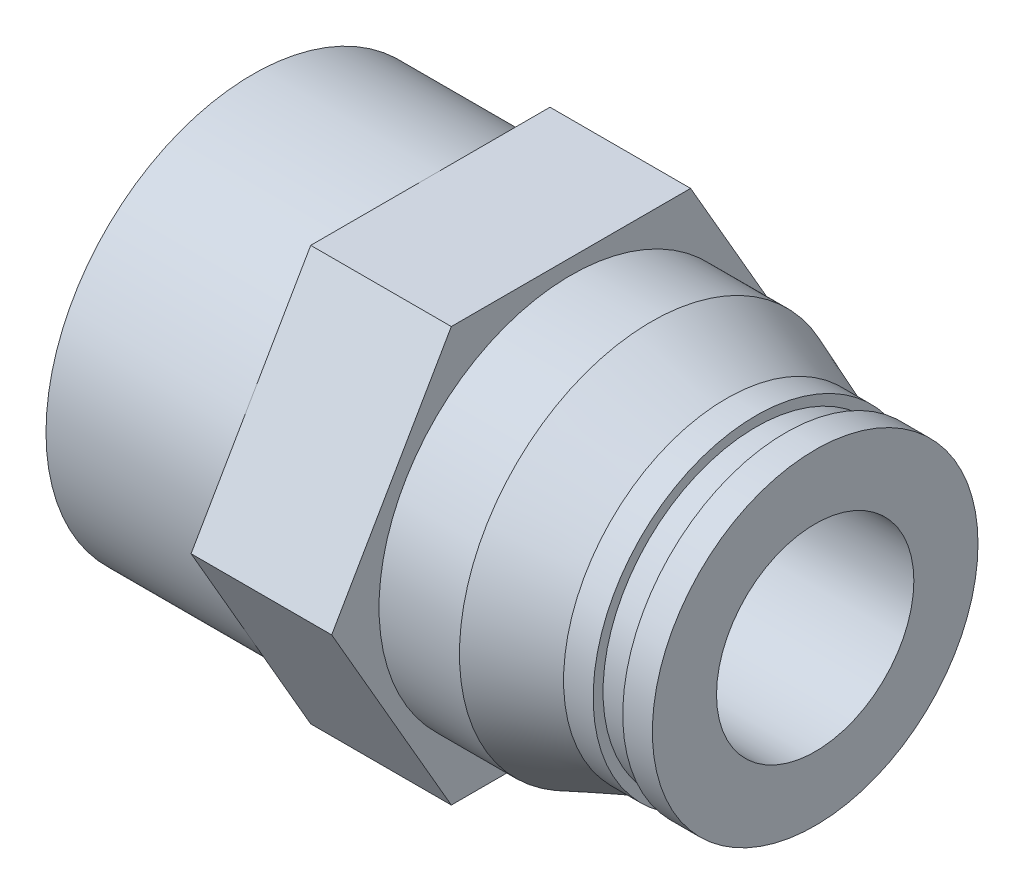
ISO-10303-21;
HEADER;
FILE_DESCRIPTION(('STEP AP214'),'2;1');
FILE_NAME('part.step','',(''),(''),'','','');
FILE_SCHEMA(('AUTOMOTIVE_DESIGN { 1 0 10303 214 1 1 1 1 }'));
ENDSEC;
DATA;
#1=APPLICATION_CONTEXT('core data for automotive mechanical design processes');
#2=APPLICATION_PROTOCOL_DEFINITION('international standard','automotive_design',2000,#1);
#3=PRODUCT_CONTEXT('',#1,'mechanical');
#4=PRODUCT('Part','Part','',(#3));
#5=PRODUCT_RELATED_PRODUCT_CATEGORY('part','',(#4));
#6=PRODUCT_DEFINITION_FORMATION('','',#4);
#7=PRODUCT_DEFINITION_CONTEXT('part definition',#1,'design');
#8=PRODUCT_DEFINITION('design','',#6,#7);
#9=PRODUCT_DEFINITION_SHAPE('','',#8);
#10=(LENGTH_UNIT() NAMED_UNIT(*) SI_UNIT(.MILLI.,.METRE.));
#11=(NAMED_UNIT(*) PLANE_ANGLE_UNIT() SI_UNIT($,.RADIAN.));
#12=(NAMED_UNIT(*) SI_UNIT($,.STERADIAN.) SOLID_ANGLE_UNIT());
#13=UNCERTAINTY_MEASURE_WITH_UNIT(LENGTH_MEASURE(1.E-05),#10,'distance_accuracy_value','');
#14=(GEOMETRIC_REPRESENTATION_CONTEXT(3) GLOBAL_UNCERTAINTY_ASSIGNED_CONTEXT((#13)) GLOBAL_UNIT_ASSIGNED_CONTEXT((#10,
#11,#12)) REPRESENTATION_CONTEXT('',''));
#15=CARTESIAN_POINT('',(0.,0.,0.));
#16=DIRECTION('',(0.,0.,1.));
#17=DIRECTION('',(1.,0.,0.));
#18=AXIS2_PLACEMENT_3D('',#15,#16,#17);
#19=CARTESIAN_POINT('',(9.,10.475,0.));
#20=DIRECTION('',(-1.,0.,0.));
#21=DIRECTION('',(0.,0.,1.));
#22=AXIS2_PLACEMENT_3D('',#19,#20,#21);
#23=PLANE('',#22);
#24=CARTESIAN_POINT('',(9.,0.,0.));
#25=DIRECTION('',(1.,0.,0.));
#26=DIRECTION('',(0.,0.,-1.));
#27=AXIS2_PLACEMENT_3D('',#24,#25,#26);
#28=CIRCLE('',#27,10.475);
#29=CARTESIAN_POINT('',(9.,0.,-10.475));
#30=VERTEX_POINT('',#29);
#31=EDGE_CURVE('E215',#30,#30,#28,.T.);
#32=ORIENTED_EDGE('',*,*,#31,.T.);
#33=EDGE_LOOP('',(#32));
#34=FACE_BOUND('',#33,.T.);
#35=DIRECTION('',(0.,-0.866025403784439,0.5));
#36=VECTOR('',#35,1.);
#37=CARTESIAN_POINT('',(9.,0.,-12.1243556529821));
#38=LINE('',#37,#36);
#39=CARTESIAN_POINT('',(9.,0.,-12.1243556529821));
#40=VERTEX_POINT('',#39);
#41=CARTESIAN_POINT('',(9.,-10.5,-6.06217782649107));
#42=VERTEX_POINT('',#41);
#43=EDGE_CURVE('E121',#40,#42,#38,.T.);
#44=ORIENTED_EDGE('',*,*,#43,.T.);
#45=DIRECTION('',(0.,0.,1.));
#46=VECTOR('',#45,1.);
#47=CARTESIAN_POINT('',(9.,-10.5,-6.06217782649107));
#48=LINE('',#47,#46);
#49=CARTESIAN_POINT('',(9.,-10.5,6.06217782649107));
#50=VERTEX_POINT('',#49);
#51=EDGE_CURVE('E106',#42,#50,#48,.T.);
#52=ORIENTED_EDGE('',*,*,#51,.T.);
#53=DIRECTION('',(0.,0.866025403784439,0.5));
#54=VECTOR('',#53,1.);
#55=CARTESIAN_POINT('',(9.,-10.5,6.06217782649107));
#56=LINE('',#55,#54);
#57=CARTESIAN_POINT('',(9.,0.,12.1243556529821));
#58=VERTEX_POINT('',#57);
#59=EDGE_CURVE('E115',#50,#58,#56,.T.);
#60=ORIENTED_EDGE('',*,*,#59,.T.);
#61=DIRECTION('',(0.,0.866025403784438,-0.5));
#62=VECTOR('',#61,1.);
#63=CARTESIAN_POINT('',(9.,0.,12.1243556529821));
#64=LINE('',#63,#62);
#65=CARTESIAN_POINT('',(9.,10.5,6.06217782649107));
#66=VERTEX_POINT('',#65);
#67=EDGE_CURVE('E30',#58,#66,#64,.T.);
#68=ORIENTED_EDGE('',*,*,#67,.T.);
#69=DIRECTION('',(0.,0.,-1.));
#70=VECTOR('',#69,1.);
#71=CARTESIAN_POINT('',(9.,10.5,6.06217782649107));
#72=LINE('',#71,#70);
#73=CARTESIAN_POINT('',(9.,10.5,-6.06217782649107));
#74=VERTEX_POINT('',#73);
#75=EDGE_CURVE('E125',#66,#74,#72,.T.);
#76=ORIENTED_EDGE('',*,*,#75,.T.);
#77=DIRECTION('',(0.,-0.866025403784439,-0.5));
#78=VECTOR('',#77,1.);
#79=CARTESIAN_POINT('',(9.,10.5,-6.06217782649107));
#80=LINE('',#79,#78);
#81=EDGE_CURVE('E128',#74,#40,#80,.T.);
#82=ORIENTED_EDGE('',*,*,#81,.T.);
#83=EDGE_LOOP('',(#44,#52,#60,#68,#76,#82));
#84=FACE_BOUND('',#83,.T.);
#85=ADVANCED_FACE('F15',(#34,#84),#23,.T.);
#86=CARTESIAN_POINT('',(16.125,12.5,0.));
#87=DIRECTION('',(1.,0.,0.));
#88=DIRECTION('',(0.,0.,-1.));
#89=AXIS2_PLACEMENT_3D('',#86,#87,#88);
#90=PLANE('',#89);
#91=CARTESIAN_POINT('',(16.125,0.,0.));
#92=DIRECTION('',(1.,0.,0.));
#93=DIRECTION('',(0.,0.,-1.));
#94=AXIS2_PLACEMENT_3D('',#91,#92,#93);
#95=CIRCLE('',#94,9.72578013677);
#96=CARTESIAN_POINT('',(16.125,0.,-9.72578013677));
#97=VERTEX_POINT('',#96);
#98=EDGE_CURVE('E212',#97,#97,#95,.T.);
#99=ORIENTED_EDGE('',*,*,#98,.F.);
#100=EDGE_LOOP('',(#99));
#101=FACE_BOUND('',#100,.T.);
#102=DIRECTION('',(0.,0.866025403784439,0.5));
#103=VECTOR('',#102,1.);
#104=CARTESIAN_POINT('',(16.125,-10.5,6.06217782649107));
#105=LINE('',#104,#103);
#106=CARTESIAN_POINT('',(16.125,-10.5,6.06217782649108));
#107=VERTEX_POINT('',#106);
#108=CARTESIAN_POINT('',(16.125,0.,12.1243556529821));
#109=VERTEX_POINT('',#108);
#110=EDGE_CURVE('E132',#107,#109,#105,.T.);
#111=ORIENTED_EDGE('',*,*,#110,.F.);
#112=DIRECTION('',(0.,0.,1.));
#113=VECTOR('',#112,1.);
#114=CARTESIAN_POINT('',(16.125,-10.5,-6.06217782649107));
#115=LINE('',#114,#113);
#116=CARTESIAN_POINT('',(16.125,-10.5,-6.06217782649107));
#117=VERTEX_POINT('',#116);
#118=EDGE_CURVE('E38',#117,#107,#115,.T.);
#119=ORIENTED_EDGE('',*,*,#118,.F.);
#120=DIRECTION('',(0.,-0.866025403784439,0.5));
#121=VECTOR('',#120,1.);
#122=CARTESIAN_POINT('',(16.125,0.,-12.1243556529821));
#123=LINE('',#122,#121);
#124=CARTESIAN_POINT('',(16.125,0.,-12.1243556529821));
#125=VERTEX_POINT('',#124);
#126=EDGE_CURVE('E112',#125,#117,#123,.T.);
#127=ORIENTED_EDGE('',*,*,#126,.F.);
#128=DIRECTION('',(0.,-0.866025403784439,-0.5));
#129=VECTOR('',#128,1.);
#130=CARTESIAN_POINT('',(16.125,10.5,-6.06217782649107));
#131=LINE('',#130,#129);
#132=CARTESIAN_POINT('',(16.125,10.5,-6.06217782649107));
#133=VERTEX_POINT('',#132);
#134=EDGE_CURVE('E140',#133,#125,#131,.T.);
#135=ORIENTED_EDGE('',*,*,#134,.F.);
#136=DIRECTION('',(0.,0.,-1.));
#137=VECTOR('',#136,1.);
#138=CARTESIAN_POINT('',(16.125,10.5,6.06217782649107));
#139=LINE('',#138,#137);
#140=CARTESIAN_POINT('',(16.125,10.5,6.06217782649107));
#141=VERTEX_POINT('',#140);
#142=EDGE_CURVE('E137',#141,#133,#139,.T.);
#143=ORIENTED_EDGE('',*,*,#142,.F.);
#144=DIRECTION('',(0.,0.866025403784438,-0.5));
#145=VECTOR('',#144,1.);
#146=CARTESIAN_POINT('',(16.125,0.,12.1243556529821));
#147=LINE('',#146,#145);
#148=EDGE_CURVE('E134',#109,#141,#147,.T.);
#149=ORIENTED_EDGE('',*,*,#148,.F.);
#150=EDGE_LOOP('',(#111,#119,#127,#135,#143,#149));
#151=FACE_BOUND('',#150,.T.);
#152=ADVANCED_FACE('F269',(#101,#151),#90,.T.);
#153=CARTESIAN_POINT('',(0.,0.,0.));
#154=DIRECTION('',(-1.,0.,0.));
#155=DIRECTION('',(0.,0.,1.));
#156=AXIS2_PLACEMENT_3D('',#153,#154,#155);
#157=PLANE('',#156);
#158=CARTESIAN_POINT('',(0.,0.,0.));
#159=DIRECTION('',(1.,0.,0.));
#160=DIRECTION('',(0.,0.,-1.));
#161=AXIS2_PLACEMENT_3D('',#158,#159,#160);
#162=CIRCLE('',#161,10.475);
#163=CARTESIAN_POINT('',(0.,0.,-10.475));
#164=VERTEX_POINT('',#163);
#165=EDGE_CURVE('E218',#164,#164,#162,.T.);
#166=ORIENTED_EDGE('',*,*,#165,.F.);
#167=EDGE_LOOP('',(#166));
#168=FACE_BOUND('',#167,.T.);
#169=DIRECTION('',(0.,-0.866025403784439,-0.5));
#170=VECTOR('',#169,1.);
#171=CARTESIAN_POINT('',(0.,0.,4.618802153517));
#172=LINE('',#171,#170);
#173=CARTESIAN_POINT('',(0.,0.,4.618802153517));
#174=VERTEX_POINT('',#173);
#175=CARTESIAN_POINT('',(0.,-4.,2.3094010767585));
#176=VERTEX_POINT('',#175);
#177=EDGE_CURVE('E169',#174,#176,#172,.T.);
#178=ORIENTED_EDGE('',*,*,#177,.T.);
#179=DIRECTION('',(0.,0.,-1.));
#180=VECTOR('',#179,1.);
#181=CARTESIAN_POINT('',(0.,-4.,2.3094010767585));
#182=LINE('',#181,#180);
#183=CARTESIAN_POINT('',(0.,-4.,-2.30940107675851));
#184=VERTEX_POINT('',#183);
#185=EDGE_CURVE('E147',#176,#184,#182,.T.);
#186=ORIENTED_EDGE('',*,*,#185,.T.);
#187=DIRECTION('',(0.,0.866025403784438,-0.5));
#188=VECTOR('',#187,1.);
#189=CARTESIAN_POINT('',(0.,-4.,-2.30940107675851));
#190=LINE('',#189,#188);
#191=CARTESIAN_POINT('',(0.,0.,-4.61880215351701));
#192=VERTEX_POINT('',#191);
#193=EDGE_CURVE('E157',#184,#192,#190,.T.);
#194=ORIENTED_EDGE('',*,*,#193,.T.);
#195=DIRECTION('',(0.,0.866025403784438,0.5));
#196=VECTOR('',#195,1.);
#197=CARTESIAN_POINT('',(0.,0.,-4.61880215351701));
#198=LINE('',#197,#196);
#199=CARTESIAN_POINT('',(0.,4.,-2.3094010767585));
#200=VERTEX_POINT('',#199);
#201=EDGE_CURVE('E160',#192,#200,#198,.T.);
#202=ORIENTED_EDGE('',*,*,#201,.T.);
#203=DIRECTION('',(0.,0.,1.));
#204=VECTOR('',#203,1.);
#205=CARTESIAN_POINT('',(0.,4.,-2.3094010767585));
#206=LINE('',#205,#204);
#207=CARTESIAN_POINT('',(0.,4.,2.3094010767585));
#208=VERTEX_POINT('',#207);
#209=EDGE_CURVE('E163',#200,#208,#206,.T.);
#210=ORIENTED_EDGE('',*,*,#209,.T.);
#211=DIRECTION('',(0.,-0.866025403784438,0.5));
#212=VECTOR('',#211,1.);
#213=CARTESIAN_POINT('',(0.,4.,2.3094010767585));
#214=LINE('',#213,#212);
#215=EDGE_CURVE('E166',#208,#174,#214,.T.);
#216=ORIENTED_EDGE('',*,*,#215,.T.);
#217=EDGE_LOOP('',(#178,#186,#194,#202,#210,#216));
#218=FACE_BOUND('',#217,.T.);
#219=ADVANCED_FACE('F17',(#168,#218),#157,.T.);
#220=CARTESIAN_POINT('',(10.,5.,0.));
#221=DIRECTION('',(1.,0.,0.));
#222=DIRECTION('',(0.,0.,-1.));
#223=AXIS2_PLACEMENT_3D('',#220,#221,#222);
#224=PLANE('',#223);
#225=CARTESIAN_POINT('',(10.,0.,0.));
#226=DIRECTION('',(1.,0.,0.));
#227=DIRECTION('',(0.,0.,-1.));
#228=AXIS2_PLACEMENT_3D('',#225,#226,#227);
#229=CIRCLE('',#228,5.);
#230=CARTESIAN_POINT('',(10.,0.,-5.));
#231=VERTEX_POINT('',#230);
#232=EDGE_CURVE('E185',#231,#231,#229,.T.);
#233=ORIENTED_EDGE('',*,*,#232,.T.);
#234=EDGE_LOOP('',(#233));
#235=FACE_BOUND('',#234,.T.);
#236=DIRECTION('',(0.,-0.866025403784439,0.5));
#237=VECTOR('',#236,1.);
#238=CARTESIAN_POINT('',(10.,1.75,-5.62916512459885));
#239=LINE('',#238,#237);
#240=CARTESIAN_POINT('',(10.,0.,-4.61880215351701));
#241=VERTEX_POINT('',#240);
#242=CARTESIAN_POINT('',(10.,-4.,-2.30940107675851));
#243=VERTEX_POINT('',#242);
#244=EDGE_CURVE('E23',#241,#243,#239,.T.);
#245=ORIENTED_EDGE('',*,*,#244,.T.);
#246=DIRECTION('',(0.,0.,1.));
#247=VECTOR('',#246,1.);
#248=CARTESIAN_POINT('',(10.,-4.,0.));
#249=LINE('',#248,#247);
#250=CARTESIAN_POINT('',(10.,-4.,2.3094010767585));
#251=VERTEX_POINT('',#250);
#252=EDGE_CURVE('E9',#243,#251,#249,.T.);
#253=ORIENTED_EDGE('',*,*,#252,.T.);
#254=DIRECTION('',(0.,0.866025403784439,0.5));
#255=VECTOR('',#254,1.);
#256=CARTESIAN_POINT('',(10.,1.75,5.62916512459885));
#257=LINE('',#256,#255);
#258=CARTESIAN_POINT('',(10.,0.,4.618802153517));
#259=VERTEX_POINT('',#258);
#260=EDGE_CURVE('E221',#251,#259,#257,.T.);
#261=ORIENTED_EDGE('',*,*,#260,.T.);
#262=DIRECTION('',(0.,0.866025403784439,-0.5));
#263=VECTOR('',#262,1.);
#264=CARTESIAN_POINT('',(10.,5.75,1.29903810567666));
#265=LINE('',#264,#263);
#266=CARTESIAN_POINT('',(10.,4.,2.3094010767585));
#267=VERTEX_POINT('',#266);
#268=EDGE_CURVE('E224',#259,#267,#265,.T.);
#269=ORIENTED_EDGE('',*,*,#268,.T.);
#270=DIRECTION('',(0.,0.,-1.));
#271=VECTOR('',#270,1.);
#272=CARTESIAN_POINT('',(10.,4.,0.));
#273=LINE('',#272,#271);
#274=CARTESIAN_POINT('',(10.,4.,-2.3094010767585));
#275=VERTEX_POINT('',#274);
#276=EDGE_CURVE('E227',#267,#275,#273,.T.);
#277=ORIENTED_EDGE('',*,*,#276,.T.);
#278=DIRECTION('',(0.,-0.866025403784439,-0.5));
#279=VECTOR('',#278,1.);
#280=CARTESIAN_POINT('',(10.,5.75,-1.29903810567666));
#281=LINE('',#280,#279);
#282=EDGE_CURVE('E230',#275,#241,#281,.T.);
#283=ORIENTED_EDGE('',*,*,#282,.T.);
#284=EDGE_LOOP('',(#245,#253,#261,#269,#277,#283));
#285=FACE_BOUND('',#284,.T.);
#286=ADVANCED_FACE('F234',(#235,#285),#224,.T.);
#287=CARTESIAN_POINT('',(0.,0.,0.));
#288=DIRECTION('',(1.,0.,0.));
#289=DIRECTION('',(0.,0.,-1.));
#290=AXIS2_PLACEMENT_3D('',#287,#288,#289);
#291=CYLINDRICAL_SURFACE('',#290,10.475);
#292=ORIENTED_EDGE('',*,*,#165,.T.);
#293=EDGE_LOOP('',(#292));
#294=FACE_BOUND('',#293,.T.);
#295=ORIENTED_EDGE('',*,*,#31,.F.);
#296=EDGE_LOOP('',(#295));
#297=FACE_BOUND('',#296,.T.);
#298=ADVANCED_FACE('F278',(#294,#297),#291,.T.);
#299=CARTESIAN_POINT('',(0.,0.,0.));
#300=DIRECTION('',(1.,0.,0.));
#301=DIRECTION('',(0.,0.,-1.));
#302=AXIS2_PLACEMENT_3D('',#299,#300,#301);
#303=CYLINDRICAL_SURFACE('',#302,9.72578013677);
#304=ORIENTED_EDGE('',*,*,#98,.T.);
#305=EDGE_LOOP('',(#304));
#306=FACE_BOUND('',#305,.T.);
#307=CARTESIAN_POINT('',(20.2007810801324,0.,0.));
#308=DIRECTION('',(1.,0.,0.));
#309=DIRECTION('',(0.,0.,-1.));
#310=AXIS2_PLACEMENT_3D('',#307,#308,#309);
#311=CIRCLE('',#310,9.72578013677);
#312=CARTESIAN_POINT('',(20.2007810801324,0.,-9.72578013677));
#313=VERTEX_POINT('',#312);
#314=EDGE_CURVE('E209',#313,#313,#311,.T.);
#315=ORIENTED_EDGE('',*,*,#314,.F.);
#316=EDGE_LOOP('',(#315));
#317=FACE_BOUND('',#316,.T.);
#318=ADVANCED_FACE('F280',(#306,#317),#303,.T.);
#319=CARTESIAN_POINT('',(24.,0.,0.));
#320=DIRECTION('',(-1.,0.,0.));
#321=DIRECTION('',(0.,0.,1.));
#322=AXIS2_PLACEMENT_3D('',#319,#320,#321);
#323=CONICAL_SURFACE('',#322,8.25,0.370503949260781);
#324=ORIENTED_EDGE('',*,*,#314,.T.);
#325=EDGE_LOOP('',(#324));
#326=FACE_BOUND('',#325,.T.);
#327=CARTESIAN_POINT('',(24.,0.,0.));
#328=DIRECTION('',(1.,0.,0.));
#329=DIRECTION('',(0.,0.,-1.));
#330=AXIS2_PLACEMENT_3D('',#327,#328,#329);
#331=CIRCLE('',#330,8.25);
#332=CARTESIAN_POINT('',(24.,0.,-8.25));
#333=VERTEX_POINT('',#332);
#334=EDGE_CURVE('E206',#333,#333,#331,.T.);
#335=ORIENTED_EDGE('',*,*,#334,.F.);
#336=EDGE_LOOP('',(#335));
#337=FACE_BOUND('',#336,.T.);
#338=ADVANCED_FACE('F286',(#326,#337),#323,.T.);
#339=CARTESIAN_POINT('',(0.,0.,0.));
#340=DIRECTION('',(1.,0.,0.));
#341=DIRECTION('',(0.,0.,-1.));
#342=AXIS2_PLACEMENT_3D('',#339,#340,#341);
#343=CYLINDRICAL_SURFACE('',#342,8.25);
#344=ORIENTED_EDGE('',*,*,#334,.T.);
#345=EDGE_LOOP('',(#344));
#346=FACE_BOUND('',#345,.T.);
#347=CARTESIAN_POINT('',(25.5,0.,0.));
#348=DIRECTION('',(1.,0.,0.));
#349=DIRECTION('',(0.,0.,-1.));
#350=AXIS2_PLACEMENT_3D('',#347,#348,#349);
#351=CIRCLE('',#350,8.25);
#352=CARTESIAN_POINT('',(25.5,0.,-8.25));
#353=VERTEX_POINT('',#352);
#354=EDGE_CURVE('E203',#353,#353,#351,.T.);
#355=ORIENTED_EDGE('',*,*,#354,.F.);
#356=EDGE_LOOP('',(#355));
#357=FACE_BOUND('',#356,.T.);
#358=ADVANCED_FACE('F330',(#346,#357),#343,.T.);
#359=CARTESIAN_POINT('',(25.5,8.25,0.));
#360=DIRECTION('',(1.,0.,0.));
#361=DIRECTION('',(0.,0.,-1.));
#362=AXIS2_PLACEMENT_3D('',#359,#360,#361);
#363=PLANE('',#362);
#364=ORIENTED_EDGE('',*,*,#354,.T.);
#365=EDGE_LOOP('',(#364));
#366=FACE_BOUND('',#365,.T.);
#367=CARTESIAN_POINT('',(25.5,0.,0.));
#368=DIRECTION('',(1.,0.,0.));
#369=DIRECTION('',(0.,0.,-1.));
#370=AXIS2_PLACEMENT_3D('',#367,#368,#369);
#371=CIRCLE('',#370,7.75);
#372=CARTESIAN_POINT('',(25.5,0.,-7.75));
#373=VERTEX_POINT('',#372);
#374=EDGE_CURVE('E200',#373,#373,#371,.T.);
#375=ORIENTED_EDGE('',*,*,#374,.F.);
#376=EDGE_LOOP('',(#375));
#377=FACE_BOUND('',#376,.T.);
#378=ADVANCED_FACE('F340',(#366,#377),#363,.T.);
#379=CARTESIAN_POINT('',(0.,0.,0.));
#380=DIRECTION('',(1.,0.,0.));
#381=DIRECTION('',(0.,0.,-1.));
#382=AXIS2_PLACEMENT_3D('',#379,#380,#381);
#383=CYLINDRICAL_SURFACE('',#382,7.75);
#384=ORIENTED_EDGE('',*,*,#374,.T.);
#385=EDGE_LOOP('',(#384));
#386=FACE_BOUND('',#385,.T.);
#387=CARTESIAN_POINT('',(27.,0.,0.));
#388=DIRECTION('',(1.,0.,0.));
#389=DIRECTION('',(0.,0.,-1.));
#390=AXIS2_PLACEMENT_3D('',#387,#388,#389);
#391=CIRCLE('',#390,7.75);
#392=CARTESIAN_POINT('',(27.,0.,-7.75));
#393=VERTEX_POINT('',#392);
#394=EDGE_CURVE('E197',#393,#393,#391,.T.);
#395=ORIENTED_EDGE('',*,*,#394,.F.);
#396=EDGE_LOOP('',(#395));
#397=FACE_BOUND('',#396,.T.);
#398=ADVANCED_FACE('F350',(#386,#397),#383,.T.);
#399=CARTESIAN_POINT('',(27.,7.75,0.));
#400=DIRECTION('',(-1.,0.,0.));
#401=DIRECTION('',(0.,0.,1.));
#402=AXIS2_PLACEMENT_3D('',#399,#400,#401);
#403=PLANE('',#402);
#404=ORIENTED_EDGE('',*,*,#394,.T.);
#405=EDGE_LOOP('',(#404));
#406=FACE_BOUND('',#405,.T.);
#407=CARTESIAN_POINT('',(27.,0.,0.));
#408=DIRECTION('',(1.,0.,0.));
#409=DIRECTION('',(0.,0.,-1.));
#410=AXIS2_PLACEMENT_3D('',#407,#408,#409);
#411=CIRCLE('',#410,8.25);
#412=CARTESIAN_POINT('',(27.,0.,-8.25));
#413=VERTEX_POINT('',#412);
#414=EDGE_CURVE('E194',#413,#413,#411,.T.);
#415=ORIENTED_EDGE('',*,*,#414,.F.);
#416=EDGE_LOOP('',(#415));
#417=FACE_BOUND('',#416,.T.);
#418=ADVANCED_FACE('F361',(#406,#417),#403,.T.);
#419=CARTESIAN_POINT('',(0.,0.,0.));
#420=DIRECTION('',(1.,0.,0.));
#421=DIRECTION('',(0.,0.,-1.));
#422=AXIS2_PLACEMENT_3D('',#419,#420,#421);
#423=CYLINDRICAL_SURFACE('',#422,8.25);
#424=ORIENTED_EDGE('',*,*,#414,.T.);
#425=EDGE_LOOP('',(#424));
#426=FACE_BOUND('',#425,.T.);
#427=CARTESIAN_POINT('',(28.5,0.,0.));
#428=DIRECTION('',(1.,0.,0.));
#429=DIRECTION('',(0.,0.,-1.));
#430=AXIS2_PLACEMENT_3D('',#427,#428,#429);
#431=CIRCLE('',#430,8.25);
#432=CARTESIAN_POINT('',(28.5,0.,-8.25));
#433=VERTEX_POINT('',#432);
#434=EDGE_CURVE('E191',#433,#433,#431,.T.);
#435=ORIENTED_EDGE('',*,*,#434,.F.);
#436=EDGE_LOOP('',(#435));
#437=FACE_BOUND('',#436,.T.);
#438=ADVANCED_FACE('F375',(#426,#437),#423,.T.);
#439=CARTESIAN_POINT('',(28.5,8.25,0.));
#440=DIRECTION('',(1.,0.,0.));
#441=DIRECTION('',(0.,0.,-1.));
#442=AXIS2_PLACEMENT_3D('',#439,#440,#441);
#443=PLANE('',#442);
#444=ORIENTED_EDGE('',*,*,#434,.T.);
#445=EDGE_LOOP('',(#444));
#446=FACE_BOUND('',#445,.T.);
#447=CARTESIAN_POINT('',(28.5,0.,0.));
#448=DIRECTION('',(1.,0.,0.));
#449=DIRECTION('',(0.,0.,-1.));
#450=AXIS2_PLACEMENT_3D('',#447,#448,#449);
#451=CIRCLE('',#450,5.);
#452=CARTESIAN_POINT('',(28.5,0.,-5.));
#453=VERTEX_POINT('',#452);
#454=EDGE_CURVE('E188',#453,#453,#451,.T.);
#455=ORIENTED_EDGE('',*,*,#454,.F.);
#456=EDGE_LOOP('',(#455));
#457=FACE_BOUND('',#456,.T.);
#458=ADVANCED_FACE('F385',(#446,#457),#443,.T.);
#459=CARTESIAN_POINT('',(0.,0.,0.));
#460=DIRECTION('',(1.,0.,0.));
#461=DIRECTION('',(0.,0.,-1.));
#462=AXIS2_PLACEMENT_3D('',#459,#460,#461);
#463=CYLINDRICAL_SURFACE('',#462,5.);
#464=ORIENTED_EDGE('',*,*,#454,.T.);
#465=EDGE_LOOP('',(#464));
#466=FACE_BOUND('',#465,.T.);
#467=ORIENTED_EDGE('',*,*,#232,.F.);
#468=EDGE_LOOP('',(#467));
#469=FACE_BOUND('',#468,.T.);
#470=ADVANCED_FACE('F396',(#466,#469),#463,.F.);
#471=CARTESIAN_POINT('',(28.5,-4.,2.3094010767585));
#472=DIRECTION('',(0.,1.,0.));
#473=DIRECTION('',(0.,0.,1.));
#474=AXIS2_PLACEMENT_3D('',#471,#472,#473);
#475=PLANE('',#474);
#476=DIRECTION('',(-1.,0.,0.));
#477=VECTOR('',#476,1.);
#478=CARTESIAN_POINT('',(28.5,-4.,-2.30940107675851));
#479=LINE('',#478,#477);
#480=EDGE_CURVE('E183',#243,#184,#479,.T.);
#481=ORIENTED_EDGE('',*,*,#480,.T.);
#482=ORIENTED_EDGE('',*,*,#185,.F.);
#483=DIRECTION('',(-1.,0.,0.));
#484=VECTOR('',#483,1.);
#485=CARTESIAN_POINT('',(28.5,-4.,2.3094010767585));
#486=LINE('',#485,#484);
#487=EDGE_CURVE('E172',#251,#176,#486,.T.);
#488=ORIENTED_EDGE('',*,*,#487,.F.);
#489=ORIENTED_EDGE('',*,*,#252,.F.);
#490=EDGE_LOOP('',(#481,#482,#488,#489));
#491=FACE_BOUND('',#490,.T.);
#492=ADVANCED_FACE('F249',(#491),#475,.T.);
#493=CARTESIAN_POINT('',(28.5,-4.,-2.30940107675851));
#494=DIRECTION('',(0.,0.5,0.866025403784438));
#495=DIRECTION('',(0.,-0.866025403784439,0.5));
#496=AXIS2_PLACEMENT_3D('',#493,#494,#495);
#497=PLANE('',#496);
#498=DIRECTION('',(-1.,0.,0.));
#499=VECTOR('',#498,1.);
#500=CARTESIAN_POINT('',(28.5,0.,-4.61880215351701));
#501=LINE('',#500,#499);
#502=EDGE_CURVE('E181',#241,#192,#501,.T.);
#503=ORIENTED_EDGE('',*,*,#502,.T.);
#504=ORIENTED_EDGE('',*,*,#193,.F.);
#505=ORIENTED_EDGE('',*,*,#480,.F.);
#506=ORIENTED_EDGE('',*,*,#244,.F.);
#507=EDGE_LOOP('',(#503,#504,#505,#506));
#508=FACE_BOUND('',#507,.T.);
#509=ADVANCED_FACE('F238',(#508),#497,.T.);
#510=CARTESIAN_POINT('',(28.5,0.,-4.61880215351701));
#511=DIRECTION('',(0.,-0.5,0.866025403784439));
#512=DIRECTION('',(0.,-0.866025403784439,-0.5));
#513=AXIS2_PLACEMENT_3D('',#510,#511,#512);
#514=PLANE('',#513);
#515=DIRECTION('',(-1.,0.,0.));
#516=VECTOR('',#515,1.);
#517=CARTESIAN_POINT('',(28.5,4.,-2.3094010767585));
#518=LINE('',#517,#516);
#519=EDGE_CURVE('E179',#275,#200,#518,.T.);
#520=ORIENTED_EDGE('',*,*,#519,.T.);
#521=ORIENTED_EDGE('',*,*,#201,.F.);
#522=ORIENTED_EDGE('',*,*,#502,.F.);
#523=ORIENTED_EDGE('',*,*,#282,.F.);
#524=EDGE_LOOP('',(#520,#521,#522,#523));
#525=FACE_BOUND('',#524,.T.);
#526=ADVANCED_FACE('F242',(#525),#514,.T.);
#527=CARTESIAN_POINT('',(28.5,4.,-2.3094010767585));
#528=DIRECTION('',(0.,-1.,0.));
#529=DIRECTION('',(0.,0.,-1.));
#530=AXIS2_PLACEMENT_3D('',#527,#528,#529);
#531=PLANE('',#530);
#532=DIRECTION('',(-1.,0.,0.));
#533=VECTOR('',#532,1.);
#534=CARTESIAN_POINT('',(28.5,4.,2.3094010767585));
#535=LINE('',#534,#533);
#536=EDGE_CURVE('E177',#267,#208,#535,.T.);
#537=ORIENTED_EDGE('',*,*,#536,.T.);
#538=ORIENTED_EDGE('',*,*,#209,.F.);
#539=ORIENTED_EDGE('',*,*,#519,.F.);
#540=ORIENTED_EDGE('',*,*,#276,.F.);
#541=EDGE_LOOP('',(#537,#538,#539,#540));
#542=FACE_BOUND('',#541,.T.);
#543=ADVANCED_FACE('F258',(#542),#531,.T.);
#544=CARTESIAN_POINT('',(28.5,4.,2.3094010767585));
#545=DIRECTION('',(0.,-0.5,-0.866025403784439));
#546=DIRECTION('',(0.,0.866025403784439,-0.5));
#547=AXIS2_PLACEMENT_3D('',#544,#545,#546);
#548=PLANE('',#547);
#549=DIRECTION('',(-1.,0.,0.));
#550=VECTOR('',#549,1.);
#551=CARTESIAN_POINT('',(28.5,0.,4.618802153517));
#552=LINE('',#551,#550);
#553=EDGE_CURVE('E175',#259,#174,#552,.T.);
#554=ORIENTED_EDGE('',*,*,#553,.T.);
#555=ORIENTED_EDGE('',*,*,#215,.F.);
#556=ORIENTED_EDGE('',*,*,#536,.F.);
#557=ORIENTED_EDGE('',*,*,#268,.F.);
#558=EDGE_LOOP('',(#554,#555,#556,#557));
#559=FACE_BOUND('',#558,.T.);
#560=ADVANCED_FACE('F255',(#559),#548,.T.);
#561=CARTESIAN_POINT('',(28.5,0.,4.618802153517));
#562=DIRECTION('',(0.,0.5,-0.866025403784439));
#563=DIRECTION('',(0.,0.866025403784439,0.5));
#564=AXIS2_PLACEMENT_3D('',#561,#562,#563);
#565=PLANE('',#564);
#566=ORIENTED_EDGE('',*,*,#487,.T.);
#567=ORIENTED_EDGE('',*,*,#177,.F.);
#568=ORIENTED_EDGE('',*,*,#553,.F.);
#569=ORIENTED_EDGE('',*,*,#260,.F.);
#570=EDGE_LOOP('',(#566,#567,#568,#569));
#571=FACE_BOUND('',#570,.T.);
#572=ADVANCED_FACE('F251',(#571),#565,.T.);
#573=CARTESIAN_POINT('',(16.125,-10.5,-6.06217782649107));
#574=DIRECTION('',(0.,-1.,0.));
#575=DIRECTION('',(0.,0.,-1.));
#576=AXIS2_PLACEMENT_3D('',#573,#574,#575);
#577=PLANE('',#576);
#578=DIRECTION('',(-1.,0.,0.));
#579=VECTOR('',#578,1.);
#580=CARTESIAN_POINT('',(16.125,-10.5,-6.06217782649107));
#581=LINE('',#580,#579);
#582=EDGE_CURVE('E145',#117,#42,#581,.T.);
#583=ORIENTED_EDGE('',*,*,#582,.F.);
#584=ORIENTED_EDGE('',*,*,#118,.T.);
#585=DIRECTION('',(-1.,0.,0.));
#586=VECTOR('',#585,1.);
#587=CARTESIAN_POINT('',(16.125,-10.5,6.06217782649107));
#588=LINE('',#587,#586);
#589=EDGE_CURVE('E102',#107,#50,#588,.T.);
#590=ORIENTED_EDGE('',*,*,#589,.T.);
#591=ORIENTED_EDGE('',*,*,#51,.F.);
#592=EDGE_LOOP('',(#583,#584,#590,#591));
#593=FACE_BOUND('',#592,.T.);
#594=ADVANCED_FACE('F104',(#593),#577,.T.);
#595=CARTESIAN_POINT('',(16.125,0.,-12.1243556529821));
#596=DIRECTION('',(0.,-0.5,-0.866025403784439));
#597=DIRECTION('',(0.,0.866025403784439,-0.5));
#598=AXIS2_PLACEMENT_3D('',#595,#596,#597);
#599=PLANE('',#598);
#600=DIRECTION('',(-1.,0.,0.));
#601=VECTOR('',#600,1.);
#602=CARTESIAN_POINT('',(16.125,0.,-12.1243556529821));
#603=LINE('',#602,#601);
#604=EDGE_CURVE('E148',#125,#40,#603,.T.);
#605=ORIENTED_EDGE('',*,*,#604,.F.);
#606=ORIENTED_EDGE('',*,*,#126,.T.);
#607=ORIENTED_EDGE('',*,*,#582,.T.);
#608=ORIENTED_EDGE('',*,*,#43,.F.);
#609=EDGE_LOOP('',(#605,#606,#607,#608));
#610=FACE_BOUND('',#609,.T.);
#611=ADVANCED_FACE('F457',(#610),#599,.T.);
#612=CARTESIAN_POINT('',(16.125,10.5,-6.06217782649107));
#613=DIRECTION('',(0.,0.5,-0.866025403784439));
#614=DIRECTION('',(0.,0.866025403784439,0.5));
#615=AXIS2_PLACEMENT_3D('',#612,#613,#614);
#616=PLANE('',#615);
#617=DIRECTION('',(-1.,0.,0.));
#618=VECTOR('',#617,1.);
#619=CARTESIAN_POINT('',(16.125,10.5,-6.06217782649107));
#620=LINE('',#619,#618);
#621=EDGE_CURVE('E150',#133,#74,#620,.T.);
#622=ORIENTED_EDGE('',*,*,#621,.F.);
#623=ORIENTED_EDGE('',*,*,#134,.T.);
#624=ORIENTED_EDGE('',*,*,#604,.T.);
#625=ORIENTED_EDGE('',*,*,#81,.F.);
#626=EDGE_LOOP('',(#622,#623,#624,#625));
#627=FACE_BOUND('',#626,.T.);
#628=ADVANCED_FACE('F466',(#627),#616,.T.);
#629=CARTESIAN_POINT('',(16.125,10.5,6.06217782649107));
#630=DIRECTION('',(0.,1.,0.));
#631=DIRECTION('',(0.,0.,1.));
#632=AXIS2_PLACEMENT_3D('',#629,#630,#631);
#633=PLANE('',#632);
#634=DIRECTION('',(-1.,0.,0.));
#635=VECTOR('',#634,1.);
#636=CARTESIAN_POINT('',(16.125,10.5,6.06217782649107));
#637=LINE('',#636,#635);
#638=EDGE_CURVE('E152',#141,#66,#637,.T.);
#639=ORIENTED_EDGE('',*,*,#638,.F.);
#640=ORIENTED_EDGE('',*,*,#142,.T.);
#641=ORIENTED_EDGE('',*,*,#621,.T.);
#642=ORIENTED_EDGE('',*,*,#75,.F.);
#643=EDGE_LOOP('',(#639,#640,#641,#642));
#644=FACE_BOUND('',#643,.T.);
#645=ADVANCED_FACE('F476',(#644),#633,.T.);
#646=CARTESIAN_POINT('',(16.125,0.,12.1243556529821));
#647=DIRECTION('',(0.,0.5,0.866025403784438));
#648=DIRECTION('',(0.,-0.866025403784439,0.5));
#649=AXIS2_PLACEMENT_3D('',#646,#647,#648);
#650=PLANE('',#649);
#651=DIRECTION('',(-1.,0.,0.));
#652=VECTOR('',#651,1.);
#653=CARTESIAN_POINT('',(16.125,0.,12.1243556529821));
#654=LINE('',#653,#652);
#655=EDGE_CURVE('E111',#109,#58,#654,.T.);
#656=ORIENTED_EDGE('',*,*,#655,.F.);
#657=ORIENTED_EDGE('',*,*,#148,.T.);
#658=ORIENTED_EDGE('',*,*,#638,.T.);
#659=ORIENTED_EDGE('',*,*,#67,.F.);
#660=EDGE_LOOP('',(#656,#657,#658,#659));
#661=FACE_BOUND('',#660,.T.);
#662=ADVANCED_FACE('F486',(#661),#650,.T.);
#663=CARTESIAN_POINT('',(16.125,-10.5,6.06217782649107));
#664=DIRECTION('',(0.,-0.5,0.866025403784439));
#665=DIRECTION('',(0.,-0.866025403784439,-0.5));
#666=AXIS2_PLACEMENT_3D('',#663,#664,#665);
#667=PLANE('',#666);
#668=ORIENTED_EDGE('',*,*,#589,.F.);
#669=ORIENTED_EDGE('',*,*,#110,.T.);
#670=ORIENTED_EDGE('',*,*,#655,.T.);
#671=ORIENTED_EDGE('',*,*,#59,.F.);
#672=EDGE_LOOP('',(#668,#669,#670,#671));
#673=FACE_BOUND('',#672,.T.);
#674=ADVANCED_FACE('F116',(#673),#667,.T.);
#675=CLOSED_SHELL('',(#85,#152,#219,#286,#298,#318,#338,#358,#378,#398,#418,#438,#458,#470,#492,
#509,#526,#543,#560,#572,#594,#611,#628,#645,#662,#674));
#676=MANIFOLD_SOLID_BREP('B1',#675);
#677=ADVANCED_BREP_SHAPE_REPRESENTATION('',(#18,#676),#14);
#678=SHAPE_DEFINITION_REPRESENTATION(#9,#677);
ENDSEC;
END-ISO-10303-21;
